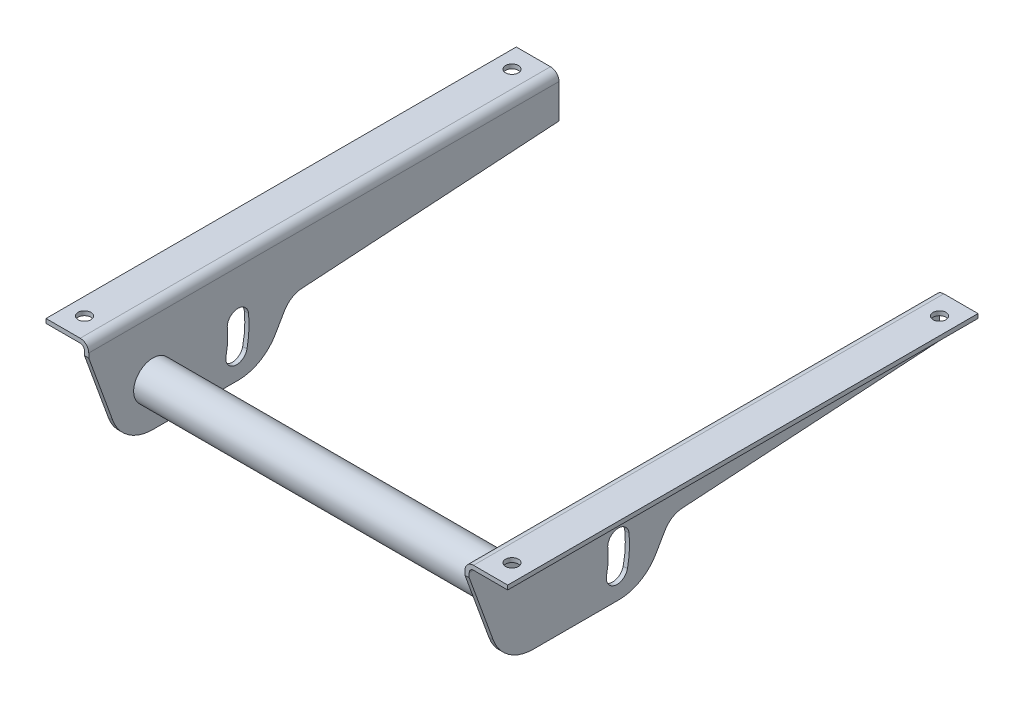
from build123d import *

# Parameters (mm, degrees)
EXTRU_MINCE1_DEPTH      = 190
EXTRU_MINCE1_DEPTH_BACK = 30
EXTRUSION1_DEPTH        = 225.196342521
ESQUISSE3_R             = 3
EXTRUSION2_DEPTH        = 225.196342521
ESQUISSE4_R             = 9
ESQUISSE4_R_2           = 6
EXTRUSION3_DEPTH        = 88


with BuildPart() as part:
    # Esquisse1 → Extru.-Mince1 (new, two sides: drawn at the far end of the back side and taken through both)
    with BuildSketch(Plane.XY.offset(-EXTRU_MINCE1_DEPTH_BACK)):
        with BuildLine():
            Line((-108, -2), (-92, -2))
            ThreePointArc((-92, -2), (-90.585786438, -2.585786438), (-90, -4))
            Line((-90, -4), (-90, -50))
            Line((-90, -50), (-88, -50))
            Line((-88, -50), (-88, -4))
            ThreePointArc((-88, -4), (-89.171572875, -1.171572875), (-92, 0))
            Line((-92, 0), (-108, 0))
            Line((-108, 0), (-108, -2))
        make_face()
    extrude(amount=EXTRU_MINCE1_DEPTH + EXTRU_MINCE1_DEPTH_BACK)

    # Esquisse2 → Extrusion1 (cut, through all)
    with BuildSketch(Plane(origin=(0, 0, 0), x_dir=(0, 0, -1), z_dir=(1, 0, 0))):
        with BuildLine():
            Line((-178.793852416, -36.840402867), (-190, -6.05176542))
            Line((-190, -6.05176542), (-190, -50))
            Line((-190, -50), (-160, -50))
            ThreePointArc((-160, -50), (-171.471528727, -46.383040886), (-178.793852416, -36.840402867))
        make_face()
        with BuildLine():
            Line((30, -20), (-90.404650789, -27.659859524))
            ThreePointArc((-90.404650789, -27.659859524), (-95.042290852, -29.142603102), (-98.430011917, -32.639684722))
            Line((-98.430011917, -32.639684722), (-102.679491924, -40))
            ThreePointArc((-102.679491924, -40), (-110, -47.320508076), (-120, -50))
            Line((-120, -50), (30, -50))
            Line((30, -50), (30, -20))
        make_face()
        with BuildLine():
            ThreePointArc((-115.983357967, -39.356026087), (-115.061670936, -32.355118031), (-115.246514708, -25.296219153))
            ThreePointArc((-115.246514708, -25.296219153), (-120.741766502, -20.846251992), (-125.191733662, -26.341503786))
            ThreePointArc((-125.191733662, -26.341503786), (-125.047966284, -31.831758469), (-125.764833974, -37.276909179))
            ThreePointArc((-125.764833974, -37.276909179), (-121.913654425, -43.207205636), (-115.983357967, -39.356026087))
        make_face()
    extrude(amount=-EXTRUSION1_DEPTH, mode=Mode.SUBTRACT)

    # Esquisse3 → Extrusion2 (cut, through all)
    with BuildSketch(Plane(origin=(0, 0, 0), x_dir=(1, 0, 0), z_dir=(0, 1, 0))):
        with Locations(Location((-100, -180, 0), (0, 0, 270))):
            Circle(ESQUISSE3_R)
        with Locations(Location((-100, 20, 0), (0, 0, 270))):
            Circle(ESQUISSE3_R)
    extrude(amount=-EXTRUSION2_DEPTH, mode=Mode.SUBTRACT)

    # Esquisse4 → Extrusion3 (add)
    with BuildSketch(Plane(origin=(-88, 0, 0), x_dir=(0, 0, -1), z_dir=(1, 0, 0))):
        with Locations(Location((-160, -30, 0), (0, 0, 180))):
            Circle(ESQUISSE4_R)
        with Locations((-160, -30)):
            Circle(ESQUISSE4_R_2, mode=Mode.SUBTRACT)
    extrude(amount=EXTRUSION3_DEPTH)

    # Sym_trie2: part across plane


with BuildPart() as part_1:
    add(part.part)
    add(part.part.mirror(Plane(origin=(0, 0, 0), x_dir=(0, 0, 1), z_dir=(1, 0, 0))))


solid = part_1.part
